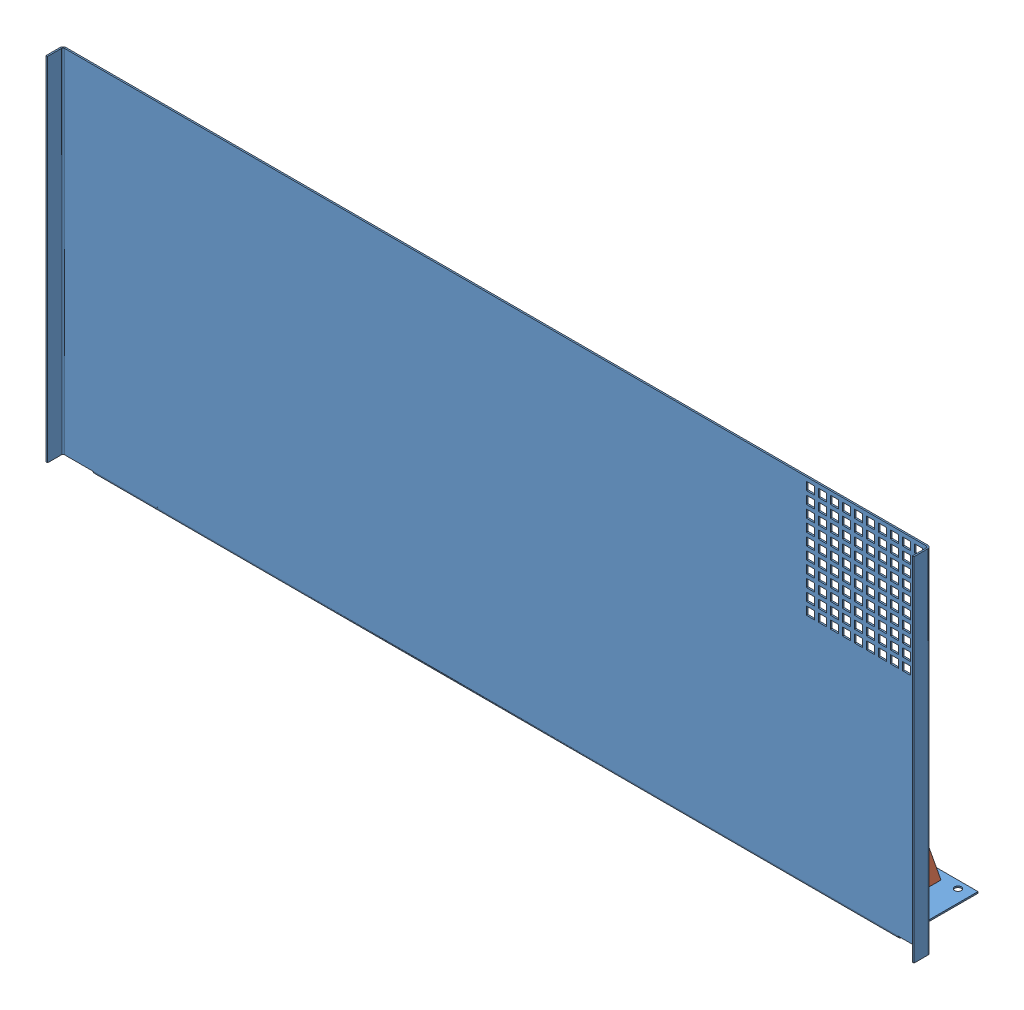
SolidWorks assembly CD032030-350 (2060).sldasm, configuration Défaut (file format 4100). Lengths in mm.
Overall size (868 355 95.5).
4 component instances, 2 part files, 9 mates.
Components (placement in the parent):
- CD032028-350 (2060)-1: CD032028-350 (2060).SLDPRT [lite] at origin size (868 355 95.5)
- CD032029-3: CD032029.SLDPRT [Défaut] at (-374 1.5 -1.5) x (0 0 -1) z (1 0 0) size (70 200 1.5)
- CD032029-4: CD032029.SLDPRT [Défaut] at (372.5 1.5 -1.5) x (0 0 -1) z (1 0 0) size (70 200 1.5)
- CD032029-5: CD032029.SLDPRT [Défaut] at (-0.75 1.5 -1.5) x (0 0 -1) z (1 0 0) size (70 200 1.5)
Mates (geometry in assembly coordinates):
- Coïncidente1: coincident anti-aligned: plane of CD032028-350 (2060)-1 through (402.5 1.5 -80) normal (0 1 0); plane of CD032029-3 through (-372.5 1.5 -1.5) normal (0 -1 0)
- Coïncidente2: coincident anti-aligned: plane of CD032028-350 (2060)-1 through (402.5 0 -1.5) normal (0 0 -1); plane of CD032029-3 through (-372.5 201.5 -1.5) normal (0 0 1)
- Distance1: distance = 60 mm aligned: plane of CD032028-350 (2060)-1 through (-434 3 0) normal (-1 0 0); plane of CD032029-3 through (-374 1.5 -1.5) normal (-1 0 0)
- Coïncidente3: coincident anti-aligned: plane of CD032028-350 (2060)-1 through (402.5 0 -1.5) normal (0 0 -1); plane of CD032029-4 through (374 201.5 -1.5) normal (0 0 1)
- Coïncidente4: coincident anti-aligned: plane of CD032028-350 (2060)-1 through (402.5 1.5 -80) normal (0 1 0); plane of CD032029-4 through (374 1.5 -1.5) normal (0 -1 0)
- Distance2: distance = 60 mm aligned: plane of CD032028-350 (2060)-1 through (434 3 15.5) normal (1 0 0); plane of CD032029-4 through (374 1.5 -1.5) normal (1 0 0)
- Coïncidente6: coincident anti-aligned: plane of CD032028-350 (2060)-1 through (402.5 0 -1.5) normal (0 0 -1); plane of CD032029-5 through (0.75 201.5 -1.5) normal (0 0 1)
- Coïncidente7: coincident anti-aligned: plane of CD032028-350 (2060)-1 through (402.5 1.5 -80) normal (0 1 0); plane of CD032029-5 through (0.75 1.5 -1.5) normal (0 -1 0)
- Distance3: distance = 0.75 mm: moEndPointRef_w of CD032028-350 (2060)-1; plane of CD032029-5 through (0.75 1.5 -1.5) normal (1 0 0)
